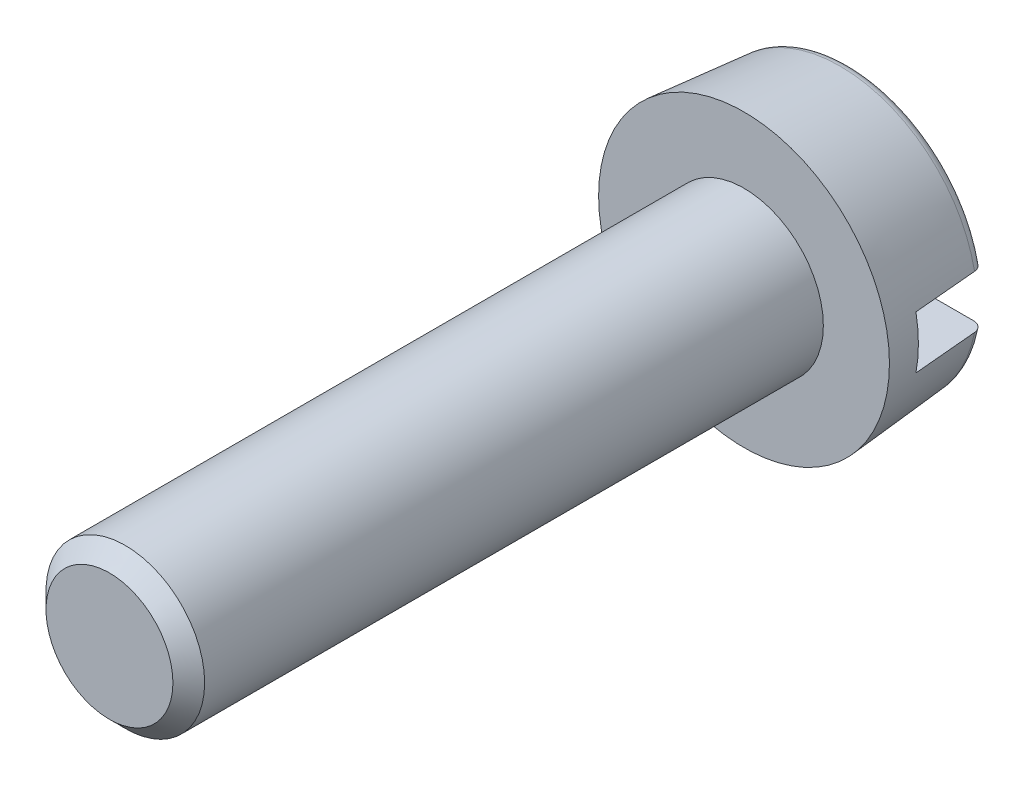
from build123d import *

# Parameters (mm, degrees)
ESQUISSE2_W             = 5.5
ESQUISSE2_H             = 1
ENLEV_MAT_EXTRU_1_DEPTH = 1.4
ESQUISSE3_W             = 1.5
ESQUISSE3_H             = 12
CHANFREIN1_SIZE         = 0.3


with BuildPart() as part:
    # Esquisse1 → Base-R_volution (revolve)
    with BuildSketch(Plane(origin=(0, 0, 0), x_dir=(1, 0, 0), z_dir=(0, 1, 0))):
        with BuildLine():
            Line((0, 0), (2.75, 0))
            Line((2.75, 0), (2.590995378, 1.817431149))
            ThreePointArc((2.590995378, 1.817431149), (2.52687448, 1.947455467), (2.391756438, 2))
            Line((2.391756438, 2), (0, 2))
            Line((0, 2), (0, 0))
        make_face()
    revolve(axis=Axis((0, 0, 0), (0, 0, -1)))

    # Esquisse2 → Enlev. mat.-Extru.1 (cut)
    with BuildSketch(Plane.XY.offset(-2)):
        Rectangle(ESQUISSE2_W, ESQUISSE2_H)
    extrude(amount=ENLEV_MAT_EXTRU_1_DEPTH, mode=Mode.SUBTRACT)

    # Esquisse3 → Boss.-R_vol.1 (revolve)
    with BuildSketch(Plane(origin=(0, 0, 0), x_dir=(1, 0, 0), z_dir=(0, 1, 0))):
        with Locations((0.75, -6)):
            Rectangle(ESQUISSE3_W, ESQUISSE3_H)
    revolve(axis=Axis((0, 0, 0), (0, 0, 1)))

    # Chanfrein1
    chanfrein1_edges = [part.edges().sort_by_distance(p)[0] for p in [
        (-1.5, 0, 12),
    ]]
    chamfer(chanfrein1_edges, length=CHANFREIN1_SIZE)


solid = part.part
